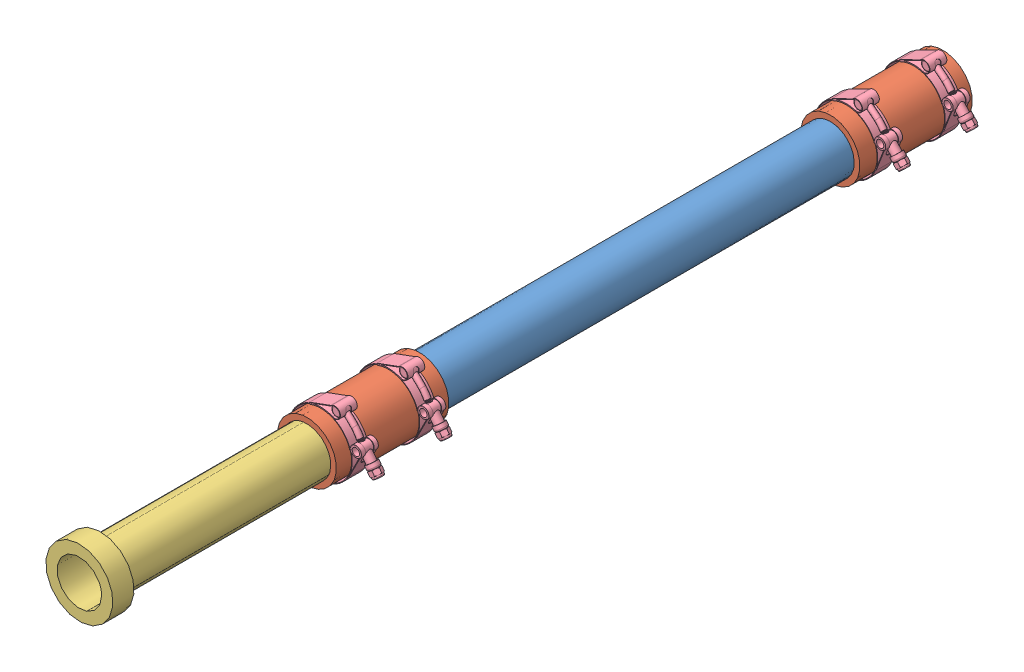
SolidWorks assembly Snoot Tube Assembly FDL 6.SLDASM, configuration Default (file format 13000). Lengths in mm.
Overall size (113.36 111.86 974.72).
8 component instances, 4 part files, 8 mates.
Components (placement in the parent):
- Intermediate Removable Pipe (23.6in)-1: Intermediate Removable Pipe (23.6in).SLDPRT [Default] at (226.5788 334.2021 144.385) size (53.98 53.98 599.44)
- Rubber Hose (5in)-1: Rubber Hose (5in).SLDPRT [Default] at (226.5788 334.2021 77.71) x (0.993974 -0.109617 0) z (0 0 1) size (66.67 66.67 127)
- Rubber Hose (5in)-2: Rubber Hose (5in).SLDPRT [Default] at (226.5788 334.2021 668.6286) x (-0.385842 0.922565 0) z (0 0 1) size (66.67 66.67 127)
- Snoot With Window (original modify)-1: Snoot With Window (original modify).SLDPRT [Default] at (226.5788 334.2021 756.525) x (0.973046 0.230612 0) z (0 0 1) size (75.82 75.82 295.91)
- 5312K657_Tight-Seal Stainless Steel Bolt Clamp for Soft Hose and Tube-1: 5312K657_Tight-Seal Stainless Steel Bolt Clamp for Soft Hose and Tube.SLDPRT [5312K657] at (226.5788 334.2021 770.4763) x (0.665067 -0.746783 0) z (0 0 1) size (81.25 79.12 19.05)
- 5312K657_Tight-Seal Stainless Steel Bolt Clamp for Soft Hose and Tube-2: 5312K657_Tight-Seal Stainless Steel Bolt Clamp for Soft Hose and Tube.SLDPRT [5312K657] at (226.5788 334.2021 694.2763) x (0.665067 -0.746783 0) z (0 0 1) size (81.25 79.12 19.05)
- 5312K657_Tight-Seal Stainless Steel Bolt Clamp for Soft Hose and Tube-3: 5312K657_Tight-Seal Stainless Steel Bolt Clamp for Soft Hose and Tube.SLDPRT [5312K657] at (226.5788 334.2021 177.2948) x (0.736605 -0.676323 0) z (0 0 1) size (81.25 79.12 19.05)
- 5312K657_Tight-Seal Stainless Steel Bolt Clamp for Soft Hose and Tube-4: 5312K657_Tight-Seal Stainless Steel Bolt Clamp for Soft Hose and Tube.SLDPRT [5312K657] at (226.5788 334.2021 101.0948) x (0.736605 -0.676323 0) z (0 0 1) size (81.25 79.12 19.05)
Mates (geometry in assembly coordinates):
- Concentric1: concentric aligned: cylinder of Intermediate Removable Pipe (23.6in)-1 through (226.5788 334.2021 743.825) axis (0 0 -1) radius 26.9875; cylinder of Rubber Hose (5in)-1 through (226.5788 334.2021 204.71) axis (0 0 -1) radius 26.9875
- Concentric2: concentric aligned: cylinder of Intermediate Removable Pipe (23.6in)-1 through (226.5788 334.2021 743.825) axis (0 0 -1) radius 26.9875; cylinder of Rubber Hose (5in)-2 through (226.5788 334.2021 795.6286) axis (0 0 -1) radius 26.9875
- LimitDistance1: limit distance = 51.8036 mm aligned: plane of Intermediate Removable Pipe (23.6in)-1 through (226.5788 334.2021 743.825) normal (0 0 1); plane of Rubber Hose (5in)-2 through (226.5788 334.2021 795.6286) normal (0 0 1)
- LimitDistance2: limit distance = 66.675 mm aligned: plane of Intermediate Removable Pipe (23.6in)-1 through (226.5788 334.2021 144.385) normal (0 0 -1); plane of Rubber Hose (5in)-1 through (226.5788 334.2021 77.71) normal (0 0 -1)
- Concentric3: concentric aligned: cylinder of Intermediate Removable Pipe (23.6in)-1 through (226.5788 334.2021 743.825) axis (0 0 -1) radius 26.9875; cylinder of Snoot With Window (original modify)-1 through (226.5788 334.2021 1052.435) axis (0 0 -1) radius 26.9875
- Distance3: distance = 12.7 mm anti-aligned: plane of Intermediate Removable Pipe (23.6in)-1 through (226.5788 334.2021 743.825) normal (0 0 1); plane of Snoot With Window (original modify)-1 through (226.5788 334.2021 756.525) normal (0 0 -1)
- Concentric4: concentric aligned: cylinder of Rubber Hose (5in)-2 through (226.5788 334.2021 795.6286) axis (0 0 -1) radius 33.3375; cylinder of 5312K657_Tight-Seal Stainless Steel Bolt Clamp for Soft Hose and Tube-1 through (226.5788 334.2021 780.0013) axis (0 0 -1) radius 34.925
- Concentric5: concentric aligned: cylinder of Rubber Hose (5in)-1 through (226.5788 334.2021 204.71) axis (0 0 -1) radius 33.3375; cylinder of 5312K657_Tight-Seal Stainless Steel Bolt Clamp for Soft Hose and Tube-3 through (226.5788 334.2021 186.8198) axis (0 0 -1) radius 34.925
